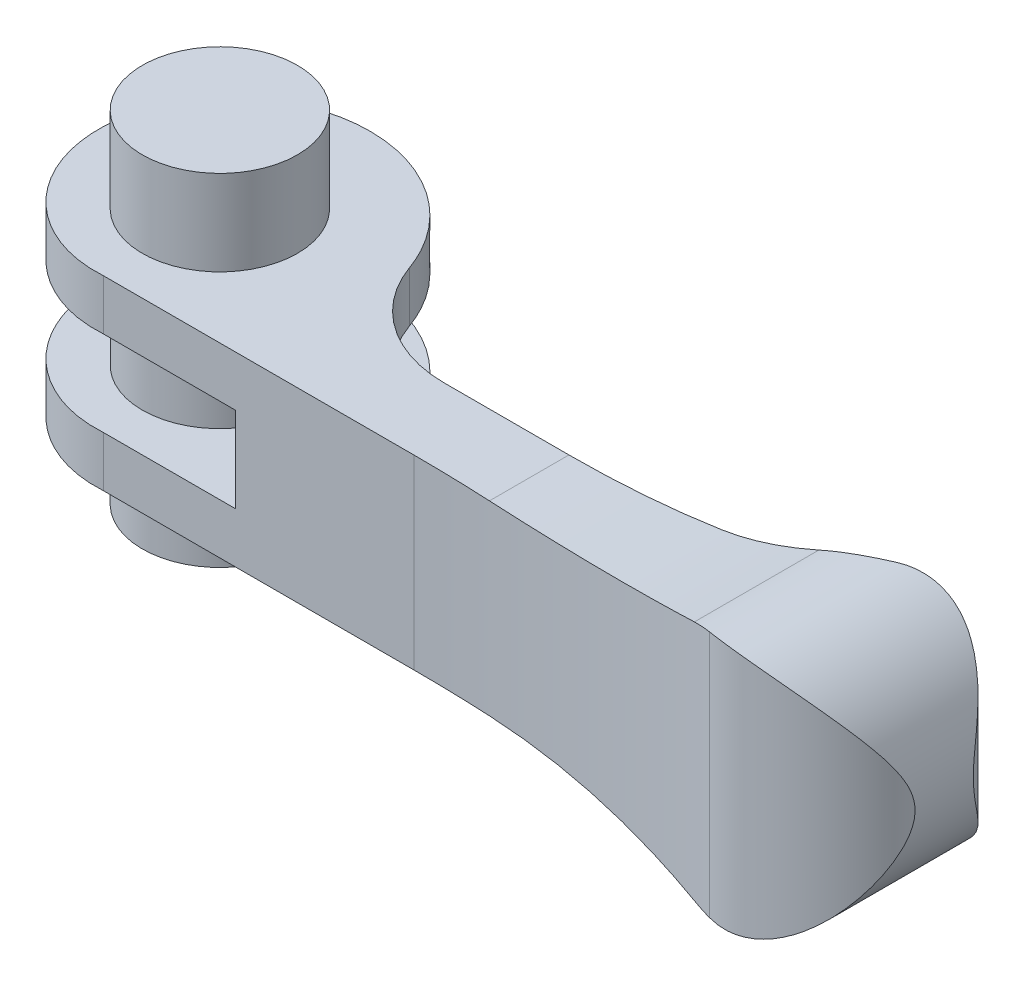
ISO-10303-21;
HEADER;
FILE_DESCRIPTION(('STEP AP214'),'2;1');
FILE_NAME('part.step','',(''),(''),'','','');
FILE_SCHEMA(('AUTOMOTIVE_DESIGN { 1 0 10303 214 1 1 1 1 }'));
ENDSEC;
DATA;
#1=APPLICATION_CONTEXT('core data for automotive mechanical design processes');
#2=APPLICATION_PROTOCOL_DEFINITION('international standard','automotive_design',2000,#1);
#3=PRODUCT_CONTEXT('',#1,'mechanical');
#4=PRODUCT('Part','Part','',(#3));
#5=PRODUCT_RELATED_PRODUCT_CATEGORY('part','',(#4));
#6=PRODUCT_DEFINITION_FORMATION('','',#4);
#7=PRODUCT_DEFINITION_CONTEXT('part definition',#1,'design');
#8=PRODUCT_DEFINITION('design','',#6,#7);
#9=PRODUCT_DEFINITION_SHAPE('','',#8);
#10=(LENGTH_UNIT() NAMED_UNIT(*) SI_UNIT(.MILLI.,.METRE.));
#11=(NAMED_UNIT(*) PLANE_ANGLE_UNIT() SI_UNIT($,.RADIAN.));
#12=(NAMED_UNIT(*) SI_UNIT($,.STERADIAN.) SOLID_ANGLE_UNIT());
#13=UNCERTAINTY_MEASURE_WITH_UNIT(LENGTH_MEASURE(1.E-05),#10,'distance_accuracy_value','');
#14=(GEOMETRIC_REPRESENTATION_CONTEXT(3) GLOBAL_UNCERTAINTY_ASSIGNED_CONTEXT((#13)) GLOBAL_UNIT_ASSIGNED_CONTEXT((#10,
#11,#12)) REPRESENTATION_CONTEXT('',''));
#15=CARTESIAN_POINT('',(0.,0.,0.));
#16=DIRECTION('',(0.,0.,1.));
#17=DIRECTION('',(1.,0.,0.));
#18=AXIS2_PLACEMENT_3D('',#15,#16,#17);
#19=CARTESIAN_POINT('',(20.0000000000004,-8.,107.050000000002));
#20=DIRECTION('',(0.,1.,0.));
#21=DIRECTION('',(1.00000000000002,0.,0.));
#22=AXIS2_PLACEMENT_3D('',#19,#20,#21);
#23=CYLINDRICAL_SURFACE('',#22,99.55);
#24=CARTESIAN_POINT('',(40.1433447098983,7.7815699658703,9.55924062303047));
#25=CARTESIAN_POINT('',(40.2458941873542,7.80603937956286,9.58042855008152));
#26=CARTESIAN_POINT('',(40.3488715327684,7.82846573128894,9.60187471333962));
#27=CARTESIAN_POINT('',(40.5553761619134,7.86918752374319,9.64522558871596));
#28=CARTESIAN_POINT('',(40.6589023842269,7.88748913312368,9.66712956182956));
#29=CARTESIAN_POINT('',(40.9704289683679,7.93625939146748,9.73356333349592));
#30=CARTESIAN_POINT('',(41.1792613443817,7.96056586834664,9.77879105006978));
#31=CARTESIAN_POINT('',(41.3886034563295,7.97660292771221,9.82484820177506));
#32=B_SPLINE_CURVE_WITH_KNOTS('',3,(#24,#25,#26,#27,#28,#29,#30,#31),.UNSPECIFIED.,.F.,.F.,(4,2,
2,4),(0.,0.322577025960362,0.644668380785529,1.28921460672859),.UNSPECIFIED.);
#33=CARTESIAN_POINT('',(40.1433447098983,7.7815699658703,9.55924062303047));
#34=VERTEX_POINT('',#33);
#35=CARTESIAN_POINT('',(41.3886034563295,7.97660292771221,9.82484820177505));
#36=VERTEX_POINT('',#35);
#37=EDGE_CURVE('E177',#34,#36,#32,.T.);
#38=ORIENTED_EDGE('',*,*,#37,.F.);
#39=CARTESIAN_POINT('',(25.0000000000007,6.,7.62564433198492));
#40=CARTESIAN_POINT('',(25.6432150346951,5.99999671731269,7.65798661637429));
#41=CARTESIAN_POINT('',(26.2860644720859,6.00951199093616,7.69657845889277));
#42=CARTESIAN_POINT('',(27.5703265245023,6.04748034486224,7.78617549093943));
#43=CARTESIAN_POINT('',(28.2117391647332,6.07593309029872,7.83718046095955));
#44=CARTESIAN_POINT('',(30.1265504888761,6.18917961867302,8.00813073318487));
#45=CARTESIAN_POINT('',(31.3968109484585,6.3018644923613,8.14632916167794));
#46=CARTESIAN_POINT('',(33.9225081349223,6.60041769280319,8.47014726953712));
#47=CARTESIAN_POINT('',(35.1779454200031,6.78628325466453,8.65576515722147));
#48=CARTESIAN_POINT('',(37.0486962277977,7.11891974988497,8.96867057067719));
#49=CARTESIAN_POINT('',(37.6717158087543,7.23913092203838,9.07903027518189));
#50=CARTESIAN_POINT('',(38.9119872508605,7.49719375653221,9.31087118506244));
#51=CARTESIAN_POINT('',(39.529239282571,7.63504489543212,9.4323520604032));
#52=CARTESIAN_POINT('',(40.1433447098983,7.7815699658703,9.55924062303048));
#53=B_SPLINE_CURVE_WITH_KNOTS('',3,(#39,#40,#41,#42,#43,#44,#45,#46,#47,#48,#49,#50,#51,#52),
.UNSPECIFIED.,.F.,.F.,(4,2,2,2,2,2,4),(0.,1.93188145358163,3.86372874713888,7.70857673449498,
11.5532794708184,13.4850725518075,15.4168083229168),.UNSPECIFIED.);
#54=CARTESIAN_POINT('',(25.0000000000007,6.,7.62564433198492));
#55=VERTEX_POINT('',#54);
#56=EDGE_CURVE('E145',#55,#34,#53,.T.);
#57=ORIENTED_EDGE('',*,*,#56,.F.);
#58=CARTESIAN_POINT('',(20.0000000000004,6.,107.050000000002));
#59=DIRECTION('',(0.,1.,0.));
#60=DIRECTION('',(1.00000000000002,0.,0.));
#61=AXIS2_PLACEMENT_3D('',#58,#59,#60);
#62=CIRCLE('',#61,99.55);
#63=CARTESIAN_POINT('',(20.0000000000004,6.,7.50000000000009));
#64=VERTEX_POINT('',#63);
#65=EDGE_CURVE('E154',#64,#55,#62,.F.);
#66=ORIENTED_EDGE('',*,*,#65,.F.);
#67=DIRECTION('',(0.,1.,0.));
#68=VECTOR('',#67,1.);
#69=CARTESIAN_POINT('',(20.0000000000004,-8.,7.50000000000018));
#70=LINE('',#69,#68);
#71=CARTESIAN_POINT('',(20.0000000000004,-6.,7.50000000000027));
#72=VERTEX_POINT('',#71);
#73=EDGE_CURVE('E303',#72,#64,#70,.T.);
#74=ORIENTED_EDGE('',*,*,#73,.F.);
#75=CARTESIAN_POINT('',(20.0000000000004,-6.,107.050000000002));
#76=DIRECTION('',(0.,1.,0.));
#77=DIRECTION('',(1.00000000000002,0.,0.));
#78=AXIS2_PLACEMENT_3D('',#75,#76,#77);
#79=CIRCLE('',#78,99.55);
#80=CARTESIAN_POINT('',(25.0000000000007,-6.,7.62564433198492));
#81=VERTEX_POINT('',#80);
#82=EDGE_CURVE('E558',#72,#81,#79,.F.);
#83=ORIENTED_EDGE('',*,*,#82,.T.);
#84=CARTESIAN_POINT('',(25.0000000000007,-6.,7.62564433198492));
#85=CARTESIAN_POINT('',(25.6432150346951,-5.99999671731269,7.65798661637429));
#86=CARTESIAN_POINT('',(26.2860644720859,-6.00951199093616,7.69657845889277));
#87=CARTESIAN_POINT('',(27.5703265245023,-6.04748034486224,7.78617549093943));
#88=CARTESIAN_POINT('',(28.2117391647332,-6.07593309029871,7.83718046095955));
#89=CARTESIAN_POINT('',(30.1265504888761,-6.189179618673,8.00813073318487));
#90=CARTESIAN_POINT('',(31.3968109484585,-6.3018644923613,8.14632916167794));
#91=CARTESIAN_POINT('',(33.9225081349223,-6.6004176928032,8.47014726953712));
#92=CARTESIAN_POINT('',(35.1779454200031,-6.78628325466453,8.65576515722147));
#93=CARTESIAN_POINT('',(37.0486962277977,-7.11891974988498,8.96867057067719));
#94=CARTESIAN_POINT('',(37.6717158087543,-7.2391309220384,9.0790302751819));
#95=CARTESIAN_POINT('',(38.9119872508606,-7.49719375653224,9.31087118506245));
#96=CARTESIAN_POINT('',(39.529239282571,-7.63504489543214,9.43235206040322));
#97=CARTESIAN_POINT('',(40.1433447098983,-7.78156996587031,9.55924062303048));
#98=B_SPLINE_CURVE_WITH_KNOTS('',3,(#84,#85,#86,#87,#88,#89,#90,#91,#92,#93,#94,#95,#96,#97),
.UNSPECIFIED.,.F.,.F.,(4,2,2,2,2,2,4),(0.,1.93188145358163,3.86372874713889,7.708576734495,
11.5532794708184,13.4850725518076,15.4168083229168),.UNSPECIFIED.);
#99=CARTESIAN_POINT('',(40.1433447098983,-7.7815699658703,9.55924062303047));
#100=VERTEX_POINT('',#99);
#101=EDGE_CURVE('E552',#81,#100,#98,.T.);
#102=ORIENTED_EDGE('',*,*,#101,.T.);
#103=CARTESIAN_POINT('',(40.1433447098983,-7.7815699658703,9.55924062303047));
#104=CARTESIAN_POINT('',(40.2458941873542,-7.80603937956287,9.58042855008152));
#105=CARTESIAN_POINT('',(40.3488715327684,-7.82846573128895,9.60187471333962));
#106=CARTESIAN_POINT('',(40.5553761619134,-7.86918752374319,9.64522558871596));
#107=CARTESIAN_POINT('',(40.6589023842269,-7.88748913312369,9.66712956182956));
#108=CARTESIAN_POINT('',(40.9704289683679,-7.93625939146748,9.73356333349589));
#109=CARTESIAN_POINT('',(41.1792613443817,-7.96056586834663,9.77879105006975));
#110=CARTESIAN_POINT('',(41.3886034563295,-7.9766029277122,9.82484820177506));
#111=B_SPLINE_CURVE_WITH_KNOTS('',3,(#103,#104,#105,#106,#107,#108,#109,#110),.UNSPECIFIED.,.F.,
.F.,(4,2,2,4),(0.,0.322577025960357,0.644668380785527,1.28921460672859),.UNSPECIFIED.);
#112=CARTESIAN_POINT('',(41.3886034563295,-7.9766029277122,9.82484820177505));
#113=VERTEX_POINT('',#112);
#114=EDGE_CURVE('E223',#100,#113,#111,.T.);
#115=ORIENTED_EDGE('',*,*,#114,.T.);
#116=DIRECTION('',(0.,1.,0.));
#117=VECTOR('',#116,1.);
#118=CARTESIAN_POINT('',(41.3886034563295,-8.,9.82484820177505));
#119=LINE('',#118,#117);
#120=EDGE_CURVE('E286',#113,#36,#119,.T.);
#121=ORIENTED_EDGE('',*,*,#120,.T.);
#122=EDGE_LOOP('',(#38,#57,#66,#74,#83,#102,#115,#121));
#123=FACE_BOUND('',#122,.T.);
#124=ADVANCED_FACE('F14',(#123),#23,.F.);
#125=CARTESIAN_POINT('',(0.,-8.,7.50000000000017));
#126=DIRECTION('',(0.,0.,-1.00000000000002));
#127=DIRECTION('',(1.00000000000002,0.,0.));
#128=AXIS2_PLACEMENT_3D('',#125,#126,#127);
#129=PLANE('',#128);
#130=DIRECTION('',(1.00000000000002,0.,0.));
#131=VECTOR('',#130,1.);
#132=CARTESIAN_POINT('',(0.,6.,7.50000000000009));
#133=LINE('',#132,#131);
#134=CARTESIAN_POINT('',(0.,6.,7.50000000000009));
#135=VERTEX_POINT('',#134);
#136=EDGE_CURVE('E165',#135,#64,#133,.T.);
#137=ORIENTED_EDGE('',*,*,#136,.F.);
#138=DIRECTION('',(0.,1.,0.));
#139=VECTOR('',#138,1.);
#140=CARTESIAN_POINT('',(0.,-8.,7.50000000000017));
#141=LINE('',#140,#139);
#142=CARTESIAN_POINT('',(0.,2.75,7.50000000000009));
#143=VERTEX_POINT('',#142);
#144=EDGE_CURVE('E294',#143,#135,#141,.T.);
#145=ORIENTED_EDGE('',*,*,#144,.F.);
#146=DIRECTION('',(1.00000000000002,0.,0.));
#147=VECTOR('',#146,1.);
#148=CARTESIAN_POINT('',(0.,2.75,7.50000000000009));
#149=LINE('',#148,#147);
#150=CARTESIAN_POINT('',(8.50000000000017,2.75,7.50000000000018));
#151=VERTEX_POINT('',#150);
#152=EDGE_CURVE('E42',#143,#151,#149,.T.);
#153=ORIENTED_EDGE('',*,*,#152,.T.);
#154=DIRECTION('',(0.,-1.,0.));
#155=VECTOR('',#154,1.);
#156=CARTESIAN_POINT('',(8.49999999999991,-8.,7.50000000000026));
#157=LINE('',#156,#155);
#158=CARTESIAN_POINT('',(8.50000000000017,-2.75,7.50000000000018));
#159=VERTEX_POINT('',#158);
#160=EDGE_CURVE('E367',#151,#159,#157,.T.);
#161=ORIENTED_EDGE('',*,*,#160,.T.);
#162=DIRECTION('',(-1.00000000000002,0.,0.));
#163=VECTOR('',#162,1.);
#164=CARTESIAN_POINT('',(0.,-2.75,7.50000000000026));
#165=LINE('',#164,#163);
#166=CARTESIAN_POINT('',(0.,-2.75,7.50000000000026));
#167=VERTEX_POINT('',#166);
#168=EDGE_CURVE('E361',#159,#167,#165,.T.);
#169=ORIENTED_EDGE('',*,*,#168,.T.);
#170=CARTESIAN_POINT('',(0.,-6.,7.50000000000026));
#171=VERTEX_POINT('',#170);
#172=EDGE_CURVE('E298',#171,#167,#141,.T.);
#173=ORIENTED_EDGE('',*,*,#172,.F.);
#174=DIRECTION('',(1.00000000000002,0.,0.));
#175=VECTOR('',#174,1.);
#176=CARTESIAN_POINT('',(0.,-6.,7.50000000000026));
#177=LINE('',#176,#175);
#178=EDGE_CURVE('E560',#171,#72,#177,.T.);
#179=ORIENTED_EDGE('',*,*,#178,.T.);
#180=ORIENTED_EDGE('',*,*,#73,.T.);
#181=EDGE_LOOP('',(#137,#145,#153,#161,#169,#173,#179,#180));
#182=FACE_BOUND('',#181,.T.);
#183=ADVANCED_FACE('F274',(#182),#129,.F.);
#184=CARTESIAN_POINT('',(0.,-8.,7.50000000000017));
#185=CARTESIAN_POINT('',(-0.981747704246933,-8.,7.56864583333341));
#186=CARTESIAN_POINT('',(-1.99074321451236,-8.,7.44195209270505));
#187=CARTESIAN_POINT('',(-3.90712600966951,-8.,6.79676377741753));
#188=CARTESIAN_POINT('',(-4.81367689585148,-8.,6.27832416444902));
#189=CARTESIAN_POINT('',(-6.37540403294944,-8.,4.91075676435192));
#190=CARTESIAN_POINT('',(-7.02981358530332,-8.,4.06201483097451));
#191=CARTESIAN_POINT('',(-7.96994804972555,-8.,2.15108987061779));
#192=CARTESIAN_POINT('',(-8.25510416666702,-8.,1.0895763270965));
#193=CARTESIAN_POINT('',(-8.39239583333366,-8.,-1.08957632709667));
#194=CARTESIAN_POINT('',(-8.24426208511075,-8.,-2.20635803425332));
#195=CARTESIAN_POINT('',(-7.51654531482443,-8.,-4.32198214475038));
#196=CARTESIAN_POINT('',(-6.93704972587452,-8.,-5.31990975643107));
#197=CARTESIAN_POINT('',(-5.41698962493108,-8.,-7.03412959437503));
#198=CARTESIAN_POINT('',(-4.47687096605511,-8.,-7.74959512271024));
#199=CARTESIAN_POINT('',(-2.36670469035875,-8.,-8.77225804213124));
#200=CARTESIAN_POINT('',(-1.19740494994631,-8.,-9.07885416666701));
#201=CARTESIAN_POINT('',(1.19740494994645,-8.,-9.21614583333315));
#202=CARTESIAN_POINT('',(2.42197285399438,-8.,-9.04657207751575));
#203=CARTESIAN_POINT('',(4.73683827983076,-8.,-8.23632685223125));
#204=CARTESIAN_POINT('',(5.82614261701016,-8.,-7.59577528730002));
#205=CARTESIAN_POINT('',(7.69285515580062,-8.,-5.9232224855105));
#206=CARTESIAN_POINT('',(8.46937666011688,-8.,-4.89172710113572));
#207=CARTESIAN_POINT('',(9.57456803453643,-8.,-2.5823195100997));
#208=CARTESIAN_POINT('',(9.90260416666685,-8.,-1.30523357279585));
#209=CARTESIAN_POINT('',(10.0398958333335,-8.,1.30523357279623));
#210=CARTESIAN_POINT('',(9.84888206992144,-8.,2.63758767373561));
#211=CARTESIAN_POINT('',(8.95610838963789,-8.,5.15169441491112));
#212=CARTESIAN_POINT('',(8.25450084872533,-8.,6.33237547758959));
#213=CARTESIAN_POINT('',(6.42945534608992,-8.,8.35158071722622));
#214=CARTESIAN_POINT('',(5.30658323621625,-8.,9.18915819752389));
#215=CARTESIAN_POINT('',(2.79793432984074,-8.,10.3768780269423));
#216=CARTESIAN_POINT('',(1.41306219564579,-8.,10.726354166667));
#217=CARTESIAN_POINT('',(-1.10114765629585E-13,-8.,10.7950000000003));
#218=B_SPLINE_CURVE_WITH_KNOTS('',3,(#184,#185,#186,#187,#188,#189,#190,#191,#192,#193,#194,
#195,#196,#197,#198,#199,#200,#201,#202,#203,#204,#205,#206,#207,#208,#209,#210,#211,#212,#213,
#214,#215,#216,#217),.UNSPECIFIED.,.F.,.F.,(4,2,2,2,2,2,2,2,2,2,2,2,2,2,2,2,4),(0.,0.0625,0.125,
0.1875,0.25,0.3125,0.375,0.4375,0.5,0.5625,0.625,0.6875,0.75,0.8125,0.875,0.9375,1.),.UNSPECIFIED.);
#219=DIRECTION('',(0.,1.,0.));
#220=VECTOR('',#219,1.);
#221=SURFACE_OF_LINEAR_EXTRUSION('',#218,#220);
#222=CARTESIAN_POINT('',(0.,6.,7.50000000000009));
#223=CARTESIAN_POINT('',(-0.981747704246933,6.,7.56864583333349));
#224=CARTESIAN_POINT('',(-1.9907432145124,6.,7.44195209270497));
#225=CARTESIAN_POINT('',(-3.9071260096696,6.,6.79676377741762));
#226=CARTESIAN_POINT('',(-4.81367689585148,6.,6.27832416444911));
#227=CARTESIAN_POINT('',(-6.37540403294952,6.,4.91075676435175));
#228=CARTESIAN_POINT('',(-7.02981358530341,6.,4.06201483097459));
#229=CARTESIAN_POINT('',(-7.96994804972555,5.99999999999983,2.15108987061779));
#230=CARTESIAN_POINT('',(-8.25510416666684,5.99999999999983,1.08957632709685));
#231=CARTESIAN_POINT('',(-8.39239583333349,5.99999999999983,-1.08957632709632));
#232=CARTESIAN_POINT('',(-8.24426208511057,5.99999999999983,-2.20635803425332));
#233=CARTESIAN_POINT('',(-7.51654531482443,5.99999999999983,-4.32198214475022));
#234=CARTESIAN_POINT('',(-6.93704972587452,5.99999999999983,-5.31990975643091));
#235=CARTESIAN_POINT('',(-5.41698962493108,5.99999999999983,-7.03412959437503));
#236=CARTESIAN_POINT('',(-4.47687096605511,5.99999999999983,-7.74959512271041));
#237=CARTESIAN_POINT('',(-2.36670469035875,6.,-8.77225804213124));
#238=CARTESIAN_POINT('',(-1.19740494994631,6.,-9.07885416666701));
#239=CARTESIAN_POINT('',(1.19740494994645,6.,-9.21614583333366));
#240=CARTESIAN_POINT('',(2.42197285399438,6.,-9.04657207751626));
#241=CARTESIAN_POINT('',(4.73683827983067,6.,-8.23632685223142));
#242=CARTESIAN_POINT('',(5.82614261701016,5.99999999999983,-7.59577528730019));
#243=CARTESIAN_POINT('',(7.69285515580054,5.99999999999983,-5.9232224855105));
#244=CARTESIAN_POINT('',(8.46937666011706,5.99999999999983,-4.89172710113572));
#245=CARTESIAN_POINT('',(9.5745680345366,5.99999999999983,-2.5823195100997));
#246=CARTESIAN_POINT('',(9.90260416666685,5.99999999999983,-1.30523357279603));
#247=CARTESIAN_POINT('',(10.0398958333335,5.99999999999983,1.30523357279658));
#248=CARTESIAN_POINT('',(9.84888206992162,5.99999999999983,2.63758767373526));
#249=CARTESIAN_POINT('',(8.95610838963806,6.,5.1516944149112));
#250=CARTESIAN_POINT('',(8.25450084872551,6.,6.33237547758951));
#251=CARTESIAN_POINT('',(6.42945534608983,6.,8.35158071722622));
#252=CARTESIAN_POINT('',(5.30658323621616,6.,9.18915819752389));
#253=CARTESIAN_POINT('',(2.7979343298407,6.,10.3768780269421));
#254=CARTESIAN_POINT('',(1.41306219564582,6.,10.7263541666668));
#255=CARTESIAN_POINT('',(-1.10662244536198E-13,6.,10.7950000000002));
#256=B_SPLINE_CURVE_WITH_KNOTS('',3,(#222,#223,#224,#225,#226,#227,#228,#229,#230,#231,#232,
#233,#234,#235,#236,#237,#238,#239,#240,#241,#242,#243,#244,#245,#246,#247,#248,#249,#250,#251,
#252,#253,#254,#255),.UNSPECIFIED.,.F.,.F.,(4,2,2,2,2,2,2,2,2,2,2,2,2,2,2,2,4),(0.,0.0625,0.125,
0.1875,0.25,0.3125,0.375,0.4375,0.5,0.5625,0.625,0.6875,0.75,0.8125,0.875,0.9375,1.),.UNSPECIFIED.);
#257=CARTESIAN_POINT('',(9.40828544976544,5.99999999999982,-2.8091588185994));
#258=VERTEX_POINT('',#257);
#259=EDGE_CURVE('E163',#258,#135,#256,.F.);
#260=ORIENTED_EDGE('',*,*,#259,.F.);
#261=DIRECTION('',(0.,1.,0.));
#262=VECTOR('',#261,1.);
#263=CARTESIAN_POINT('',(9.40828544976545,7.99999999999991,-2.80915881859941));
#264=LINE('',#263,#262);
#265=CARTESIAN_POINT('',(9.40828544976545,2.74999999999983,-2.80915881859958));
#266=VERTEX_POINT('',#265);
#267=EDGE_CURVE('E35',#258,#266,#264,.F.);
#268=ORIENTED_EDGE('',*,*,#267,.T.);
#269=CARTESIAN_POINT('',(0.,2.75,7.50000000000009));
#270=CARTESIAN_POINT('',(-0.981747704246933,2.75,7.56864583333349));
#271=CARTESIAN_POINT('',(-1.99074321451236,2.75,7.44195209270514));
#272=CARTESIAN_POINT('',(-3.9071260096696,2.75,6.79676377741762));
#273=CARTESIAN_POINT('',(-4.81367689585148,2.75,6.27832416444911));
#274=CARTESIAN_POINT('',(-6.37540403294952,2.75,4.91075676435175));
#275=CARTESIAN_POINT('',(-7.02981358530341,2.75,4.06201483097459));
#276=CARTESIAN_POINT('',(-7.96994804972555,2.74999999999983,2.15108987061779));
#277=CARTESIAN_POINT('',(-8.25510416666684,2.74999999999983,1.08957632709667));
#278=CARTESIAN_POINT('',(-8.39239583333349,2.74999999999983,-1.08957632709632));
#279=CARTESIAN_POINT('',(-8.24426208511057,2.74999999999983,-2.20635803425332));
#280=CARTESIAN_POINT('',(-7.51654531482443,2.74999999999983,-4.32198214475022));
#281=CARTESIAN_POINT('',(-6.93704972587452,2.74999999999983,-5.31990975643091));
#282=CARTESIAN_POINT('',(-5.41698962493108,2.74999999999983,-7.03412959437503));
#283=CARTESIAN_POINT('',(-4.47687096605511,2.74999999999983,-7.74959512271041));
#284=CARTESIAN_POINT('',(-2.36670469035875,2.74999999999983,-8.77225804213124));
#285=CARTESIAN_POINT('',(-1.19740494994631,2.74999999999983,-9.07885416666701));
#286=CARTESIAN_POINT('',(1.19740494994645,2.74999999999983,-9.21614583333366));
#287=CARTESIAN_POINT('',(2.42197285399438,2.74999999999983,-9.04657207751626));
#288=CARTESIAN_POINT('',(4.73683827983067,2.74999999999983,-8.23632685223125));
#289=CARTESIAN_POINT('',(5.82614261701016,2.75,-7.59577528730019));
#290=CARTESIAN_POINT('',(7.69285515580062,2.75,-5.9232224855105));
#291=CARTESIAN_POINT('',(8.46937666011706,2.75,-4.89172710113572));
#292=CARTESIAN_POINT('',(9.5745680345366,2.74999999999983,-2.5823195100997));
#293=CARTESIAN_POINT('',(9.90260416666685,2.74999999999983,-1.30523357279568));
#294=CARTESIAN_POINT('',(10.0398958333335,2.74999999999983,1.30523357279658));
#295=CARTESIAN_POINT('',(9.84888206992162,2.74999999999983,2.63758767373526));
#296=CARTESIAN_POINT('',(8.95610838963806,2.75,5.1516944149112));
#297=CARTESIAN_POINT('',(8.25450084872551,2.75,6.33237547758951));
#298=CARTESIAN_POINT('',(6.42945534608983,2.75,8.35158071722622));
#299=CARTESIAN_POINT('',(5.30658323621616,2.75,9.18915819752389));
#300=CARTESIAN_POINT('',(2.79793432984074,2.75,10.3768780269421));
#301=CARTESIAN_POINT('',(1.41306219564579,2.75,10.7263541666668));
#302=CARTESIAN_POINT('',(-1.10535151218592E-13,2.75,10.7950000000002));
#303=B_SPLINE_CURVE_WITH_KNOTS('',3,(#269,#270,#271,#272,#273,#274,#275,#276,#277,#278,#279,
#280,#281,#282,#283,#284,#285,#286,#287,#288,#289,#290,#291,#292,#293,#294,#295,#296,#297,#298,
#299,#300,#301,#302),.UNSPECIFIED.,.F.,.F.,(4,2,2,2,2,2,2,2,2,2,2,2,2,2,2,2,4),(0.,0.0625,0.125,
0.1875,0.25,0.3125,0.375,0.4375,0.5,0.5625,0.625,0.6875,0.75,0.8125,0.875,0.9375,1.),.UNSPECIFIED.);
#304=EDGE_CURVE('E309',#266,#143,#303,.F.);
#305=ORIENTED_EDGE('',*,*,#304,.T.);
#306=ORIENTED_EDGE('',*,*,#144,.T.);
#307=EDGE_LOOP('',(#260,#268,#305,#306));
#308=FACE_BOUND('',#307,.T.);
#309=ADVANCED_FACE('F280',(#308),#221,.F.);
#310=CARTESIAN_POINT('',(9.7876235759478,-8.,2.50000000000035));
#311=DIRECTION('',(0.,0.,1.00000000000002));
#312=DIRECTION('',(-1.00000000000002,0.,0.));
#313=AXIS2_PLACEMENT_3D('',#310,#311,#312);
#314=PLANE('',#313);
#315=CARTESIAN_POINT('',(25.0000000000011,71.25,2.50000000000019));
#316=DIRECTION('',(0.,0.,1.00000000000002));
#317=DIRECTION('',(-1.00000000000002,0.,0.));
#318=AXIS2_PLACEMENT_3D('',#315,#316,#317);
#319=CIRCLE('',#318,65.25);
#320=CARTESIAN_POINT('',(34.8532515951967,6.74824860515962,2.5));
#321=VERTEX_POINT('',#320);
#322=CARTESIAN_POINT('',(25.0000000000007,5.99999999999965,2.50000000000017));
#323=VERTEX_POINT('',#322);
#324=EDGE_CURVE('E134',#321,#323,#319,.F.);
#325=ORIENTED_EDGE('',*,*,#324,.F.);
#326=DIRECTION('',(0.,1.,0.));
#327=VECTOR('',#326,1.);
#328=CARTESIAN_POINT('',(34.8532515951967,-8.,2.5));
#329=LINE('',#328,#327);
#330=CARTESIAN_POINT('',(34.8532515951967,-6.74824860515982,2.5));
#331=VERTEX_POINT('',#330);
#332=EDGE_CURVE('E290',#331,#321,#329,.T.);
#333=ORIENTED_EDGE('',*,*,#332,.F.);
#334=CARTESIAN_POINT('',(25.0000000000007,-71.25,2.5));
#335=DIRECTION('',(0.,0.,1.00000000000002));
#336=DIRECTION('',(-1.00000000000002,0.,0.));
#337=AXIS2_PLACEMENT_3D('',#334,#335,#336);
#338=CIRCLE('',#337,65.25);
#339=CARTESIAN_POINT('',(25.0000000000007,-6.,2.5));
#340=VERTEX_POINT('',#339);
#341=EDGE_CURVE('E258',#331,#340,#338,.T.);
#342=ORIENTED_EDGE('',*,*,#341,.T.);
#343=DIRECTION('',(-1.00000000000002,0.,0.));
#344=VECTOR('',#343,1.);
#345=CARTESIAN_POINT('',(9.7876235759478,-6.,2.5));
#346=LINE('',#345,#344);
#347=CARTESIAN_POINT('',(16.942167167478,-6.,2.5));
#348=VERTEX_POINT('',#347);
#349=EDGE_CURVE('E330',#340,#348,#346,.T.);
#350=ORIENTED_EDGE('',*,*,#349,.T.);
#351=DIRECTION('',(0.,-1.,0.));
#352=VECTOR('',#351,1.);
#353=CARTESIAN_POINT('',(16.942167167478,7.99999999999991,2.50000000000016));
#354=LINE('',#353,#352);
#355=CARTESIAN_POINT('',(16.942167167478,-2.75,2.5));
#356=VERTEX_POINT('',#355);
#357=EDGE_CURVE('E315',#348,#356,#354,.F.);
#358=ORIENTED_EDGE('',*,*,#357,.T.);
#359=DIRECTION('',(-1.00000000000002,0.,0.));
#360=VECTOR('',#359,1.);
#361=CARTESIAN_POINT('',(18.5000000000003,-2.75,2.50000000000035));
#362=LINE('',#361,#360);
#363=CARTESIAN_POINT('',(8.50000000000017,-2.75,2.5));
#364=VERTEX_POINT('',#363);
#365=EDGE_CURVE('E341',#356,#364,#362,.T.);
#366=ORIENTED_EDGE('',*,*,#365,.T.);
#367=DIRECTION('',(0.,1.,0.));
#368=VECTOR('',#367,1.);
#369=CARTESIAN_POINT('',(8.50000000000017,-2.75,2.5));
#370=LINE('',#369,#368);
#371=CARTESIAN_POINT('',(8.50000000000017,2.74999999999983,2.5));
#372=VERTEX_POINT('',#371);
#373=EDGE_CURVE('E339',#364,#372,#370,.T.);
#374=ORIENTED_EDGE('',*,*,#373,.T.);
#375=DIRECTION('',(-1.00000000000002,0.,0.));
#376=VECTOR('',#375,1.);
#377=CARTESIAN_POINT('',(18.5000000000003,2.75,2.50000000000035));
#378=LINE('',#377,#376);
#379=CARTESIAN_POINT('',(16.942167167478,2.75,2.5));
#380=VERTEX_POINT('',#379);
#381=EDGE_CURVE('E336',#380,#372,#378,.T.);
#382=ORIENTED_EDGE('',*,*,#381,.F.);
#383=CARTESIAN_POINT('',(16.942167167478,6.,2.50000000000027));
#384=VERTEX_POINT('',#383);
#385=EDGE_CURVE('E162',#380,#384,#354,.F.);
#386=ORIENTED_EDGE('',*,*,#385,.T.);
#387=DIRECTION('',(-1.00000000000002,0.,0.));
#388=VECTOR('',#387,1.);
#389=CARTESIAN_POINT('',(9.78762357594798,5.99999999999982,2.5));
#390=LINE('',#389,#388);
#391=EDGE_CURVE('E151',#323,#384,#390,.T.);
#392=ORIENTED_EDGE('',*,*,#391,.F.);
#393=EDGE_LOOP('',(#325,#333,#342,#350,#358,#366,#374,#382,#386,#392));
#394=FACE_BOUND('',#393,.T.);
#395=ADVANCED_FACE('F159',(#394),#314,.F.);
#396=CARTESIAN_POINT('',(34.8532515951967,-8.,-12.5));
#397=DIRECTION('',(0.,1.,0.));
#398=DIRECTION('',(1.00000000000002,0.,0.));
#399=AXIS2_PLACEMENT_3D('',#396,#397,#398);
#400=CYLINDRICAL_SURFACE('',#399,15.);
#401=CARTESIAN_POINT('',(43.4276734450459,7.87157852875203,-0.192307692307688));
#402=CARTESIAN_POINT('',(43.2330964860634,7.90688424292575,-0.0567088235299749));
#403=CARTESIAN_POINT('',(43.0343618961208,7.93546031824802,0.0748476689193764));
#404=CARTESIAN_POINT('',(42.6294150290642,7.97779975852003,0.329195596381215));
#405=CARTESIAN_POINT('',(42.423191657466,7.99154013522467,0.451973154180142));
#406=CARTESIAN_POINT('',(42.0087624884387,8.00262854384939,0.685377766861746));
#407=CARTESIAN_POINT('',(41.8006722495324,8.00028859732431,0.796193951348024));
#408=CARTESIAN_POINT('',(41.3803562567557,7.97873783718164,1.00748429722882));
#409=CARTESIAN_POINT('',(41.1681347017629,7.95954335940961,1.1079683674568));
#410=CARTESIAN_POINT('',(40.8205226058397,7.9137322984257,1.26274941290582));
#411=CARTESIAN_POINT('',(40.6858632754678,7.89251801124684,1.32034222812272));
#412=CARTESIAN_POINT('',(40.4152492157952,7.84267986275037,1.43146636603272));
#413=CARTESIAN_POINT('',(40.2792916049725,7.81401139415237,1.48497063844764));
#414=CARTESIAN_POINT('',(40.1433447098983,7.78156996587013,1.53620015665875));
#415=B_SPLINE_CURVE_WITH_KNOTS('',3,(#401,#402,#403,#404,#405,#406,#407,#408,#409,#410,#411,
#412,#413,#414),.UNSPECIFIED.,.F.,.F.,(4,2,2,2,2,2,4),(0.,0.719320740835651,1.43975449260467,
2.14624901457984,2.85205953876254,3.29579458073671,3.74224871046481),.UNSPECIFIED.);
#416=CARTESIAN_POINT('',(43.4276734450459,7.87157852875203,-0.192307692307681));
#417=VERTEX_POINT('',#416);
#418=CARTESIAN_POINT('',(40.1433447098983,7.78156996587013,1.53620015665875));
#419=VERTEX_POINT('',#418);
#420=EDGE_CURVE('E146',#417,#419,#415,.T.);
#421=ORIENTED_EDGE('',*,*,#420,.F.);
#422=DIRECTION('',(0.,1.,0.));
#423=VECTOR('',#422,1.);
#424=CARTESIAN_POINT('',(43.4276734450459,-8.,-0.192307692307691));
#425=LINE('',#424,#423);
#426=CARTESIAN_POINT('',(43.4276734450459,-7.8715785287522,-0.192307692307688));
#427=VERTEX_POINT('',#426);
#428=EDGE_CURVE('E295',#427,#417,#425,.T.);
#429=ORIENTED_EDGE('',*,*,#428,.F.);
#430=CARTESIAN_POINT('',(43.4276734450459,-7.8715785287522,-0.192307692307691));
#431=CARTESIAN_POINT('',(43.2330964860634,-7.90688424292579,-0.056708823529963));
#432=CARTESIAN_POINT('',(43.0343618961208,-7.93546031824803,0.0748476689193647));
#433=CARTESIAN_POINT('',(42.6294150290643,-7.97779975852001,0.329195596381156));
#434=CARTESIAN_POINT('',(42.4231916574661,-7.99154013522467,0.451973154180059));
#435=CARTESIAN_POINT('',(42.0087624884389,-8.00262854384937,0.685377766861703));
#436=CARTESIAN_POINT('',(41.8006722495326,-8.00028859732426,0.79619395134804));
#437=CARTESIAN_POINT('',(41.3803562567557,-7.9787378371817,1.00748429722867));
#438=CARTESIAN_POINT('',(41.1681347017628,-7.95954335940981,1.10796836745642));
#439=CARTESIAN_POINT('',(40.8205226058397,-7.91373229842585,1.26274941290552));
#440=CARTESIAN_POINT('',(40.6858632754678,-7.89251801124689,1.32034222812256));
#441=CARTESIAN_POINT('',(40.4152492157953,-7.84267986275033,1.43146636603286));
#442=CARTESIAN_POINT('',(40.2792916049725,-7.81401139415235,1.48497063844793));
#443=CARTESIAN_POINT('',(40.1433447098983,-7.7815699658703,1.5362001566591));
#444=B_SPLINE_CURVE_WITH_KNOTS('',3,(#430,#431,#432,#433,#434,#435,#436,#437,#438,#439,#440,
#441,#442,#443),.UNSPECIFIED.,.F.,.F.,(4,2,2,2,2,2,4),(0.,0.719320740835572,1.43975449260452,
2.14624901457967,2.85205953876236,3.29579458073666,3.74224871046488),.UNSPECIFIED.);
#445=CARTESIAN_POINT('',(40.1433447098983,-7.7815699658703,1.5362001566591));
#446=VERTEX_POINT('',#445);
#447=EDGE_CURVE('E224',#427,#446,#444,.T.);
#448=ORIENTED_EDGE('',*,*,#447,.T.);
#449=CARTESIAN_POINT('',(40.1433447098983,-7.7815699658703,1.53620015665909));
#450=CARTESIAN_POINT('',(39.7226989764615,-7.68115987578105,1.69478191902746));
#451=CARTESIAN_POINT('',(39.2943354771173,-7.58341808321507,1.83458508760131));
#452=CARTESIAN_POINT('',(38.4289272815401,-7.39532588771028,2.07443745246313));
#453=CARTESIAN_POINT('',(37.9919803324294,-7.30492227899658,2.1747978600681));
#454=CARTESIAN_POINT('',(37.1092559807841,-7.13189825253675,2.33616373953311));
#455=CARTESIAN_POINT('',(36.6634781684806,-7.04927819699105,2.39716738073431));
#456=CARTESIAN_POINT('',(35.9892167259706,-6.93163307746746,2.45864735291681));
#457=CARTESIAN_POINT('',(35.7625819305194,-6.89332037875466,2.47413735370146));
#458=CARTESIAN_POINT('',(35.3084550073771,-6.81901948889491,2.4948140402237));
#459=CARTESIAN_POINT('',(35.0809628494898,-6.78303138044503,2.50000035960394));
#460=CARTESIAN_POINT('',(34.8532515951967,-6.74824860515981,2.5));
#461=B_SPLINE_CURVE_WITH_KNOTS('',3,(#449,#450,#451,#452,#453,#454,#455,#456,#457,#458,#459,
#460),.UNSPECIFIED.,.F.,.F.,(4,2,2,2,2,4),(0.,1.38140175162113,2.75167395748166,
4.12200989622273,4.81291351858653,5.50384170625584),.UNSPECIFIED.);
#462=EDGE_CURVE('E292',#446,#331,#461,.T.);
#463=ORIENTED_EDGE('',*,*,#462,.T.);
#464=ORIENTED_EDGE('',*,*,#332,.T.);
#465=CARTESIAN_POINT('',(40.1433447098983,7.78156996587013,1.53620015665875));
#466=CARTESIAN_POINT('',(39.7226989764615,7.68115987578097,1.69478191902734));
#467=CARTESIAN_POINT('',(39.2943354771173,7.58341808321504,1.83458508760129));
#468=CARTESIAN_POINT('',(38.4289272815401,7.3953258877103,2.07443745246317));
#469=CARTESIAN_POINT('',(37.9919803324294,7.3049222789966,2.17479786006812));
#470=CARTESIAN_POINT('',(37.1092559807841,7.13189825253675,2.33616373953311));
#471=CARTESIAN_POINT('',(36.6634781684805,7.04927819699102,2.39716738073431));
#472=CARTESIAN_POINT('',(35.9892167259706,6.93163307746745,2.45864735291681));
#473=CARTESIAN_POINT('',(35.7625819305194,6.89332037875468,2.47413735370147));
#474=CARTESIAN_POINT('',(35.3084550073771,6.8190194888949,2.4948140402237));
#475=CARTESIAN_POINT('',(35.0809628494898,6.78303138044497,2.50000035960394));
#476=CARTESIAN_POINT('',(34.8532515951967,6.74824860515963,2.5));
#477=B_SPLINE_CURVE_WITH_KNOTS('',3,(#465,#466,#467,#468,#469,#470,#471,#472,#473,#474,#475,
#476),.UNSPECIFIED.,.F.,.F.,(4,2,2,2,2,4),(0.,1.38140175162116,2.75167395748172,
4.12200989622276,4.81291351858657,5.50384170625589),.UNSPECIFIED.);
#478=EDGE_CURVE('E9',#419,#321,#477,.T.);
#479=ORIENTED_EDGE('',*,*,#478,.F.);
#480=EDGE_LOOP('',(#421,#429,#448,#463,#464,#479));
#481=FACE_BOUND('',#480,.T.);
#482=ADVANCED_FACE('F188',(#481),#400,.F.);
#483=CARTESIAN_POINT('',(46.0000000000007,-8.,3.50000000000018));
#484=DIRECTION('',(0.,1.,0.));
#485=DIRECTION('',(1.00000000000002,0.,0.));
#486=AXIS2_PLACEMENT_3D('',#483,#484,#485);
#487=CYLINDRICAL_SURFACE('',#486,4.5);
#488=ORIENTED_EDGE('',*,*,#428,.T.);
#489=CARTESIAN_POINT('',(43.4276734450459,7.87157852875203,-0.192307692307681));
#490=CARTESIAN_POINT('',(43.5232585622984,7.85425856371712,-0.258928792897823));
#491=CARTESIAN_POINT('',(43.621184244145,7.83468392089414,-0.321607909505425));
#492=CARTESIAN_POINT('',(43.820746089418,7.79071577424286,-0.438804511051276));
#493=CARTESIAN_POINT('',(43.9223816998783,7.76632298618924,-0.493323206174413));
#494=CARTESIAN_POINT('',(44.1279526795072,7.71252682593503,-0.593712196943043));
#495=CARTESIAN_POINT('',(44.2318754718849,7.68314677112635,-0.639620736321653));
#496=CARTESIAN_POINT('',(44.4414685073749,7.61913593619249,-0.722996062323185));
#497=CARTESIAN_POINT('',(44.5471386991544,7.58450531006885,-0.76046309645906));
#498=CARTESIAN_POINT('',(44.7592373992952,7.50994309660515,-0.826992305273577));
#499=CARTESIAN_POINT('',(44.8656658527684,7.47001188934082,-0.85605508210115));
#500=CARTESIAN_POINT('',(45.0783878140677,7.38489389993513,-0.905970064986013));
#501=CARTESIAN_POINT('',(45.1846812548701,7.33970511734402,-0.926819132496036));
#502=CARTESIAN_POINT('',(45.3962371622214,7.24424197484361,-0.960599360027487));
#503=CARTESIAN_POINT('',(45.5014995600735,7.1939672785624,-0.973529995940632));
#504=CARTESIAN_POINT('',(45.7102658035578,7.08855491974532,-0.991886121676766));
#505=CARTESIAN_POINT('',(45.813768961,7.03341540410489,-0.997308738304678));
#506=CARTESIAN_POINT('',(46.0228790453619,6.91602811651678,-1.0012098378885));
#507=CARTESIAN_POINT('',(46.1283757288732,6.85357356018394,-0.99936972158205));
#508=CARTESIAN_POINT('',(46.3361454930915,6.7240506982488,-0.988634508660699));
#509=CARTESIAN_POINT('',(46.4384173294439,6.65698064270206,-0.979736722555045));
#510=CARTESIAN_POINT('',(46.7397120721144,6.44937990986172,-0.943391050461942));
#511=CARTESIAN_POINT('',(46.9332590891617,6.30243340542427,-0.906291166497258));
#512=CARTESIAN_POINT('',(47.2636061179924,6.0274695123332,-0.821561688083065));
#513=CARTESIAN_POINT('',(47.4037056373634,5.90209818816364,-0.777864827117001));
#514=CARTESIAN_POINT('',(47.6729193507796,5.64382658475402,-0.679935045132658));
#515=CARTESIAN_POINT('',(47.8020283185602,5.51092277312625,-0.625697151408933));
#516=CARTESIAN_POINT('',(48.173097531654,5.10182618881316,-0.450019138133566));
#517=CARTESIAN_POINT('',(48.3982631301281,4.81570115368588,-0.315767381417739));
#518=CARTESIAN_POINT('',(48.7387591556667,4.31840281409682,-0.0745883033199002));
#519=CARTESIAN_POINT('',(48.8661331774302,4.11269079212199,0.0272560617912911));
#520=CARTESIAN_POINT('',(49.1011367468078,3.69213917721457,0.23540844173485));
#521=CARTESIAN_POINT('',(49.2087515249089,3.47729290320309,0.341719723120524));
#522=CARTESIAN_POINT('',(49.404374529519,3.03857594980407,0.553645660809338));
#523=CARTESIAN_POINT('',(49.492385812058,2.81470668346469,0.659260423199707));
#524=CARTESIAN_POINT('',(49.6486711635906,2.35717822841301,0.863029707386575));
#525=CARTESIAN_POINT('',(49.7169671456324,2.12353024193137,0.961192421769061));
#526=CARTESIAN_POINT('',(49.8330737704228,1.64425791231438,1.14014631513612));
#527=CARTESIAN_POINT('',(49.8808886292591,1.398636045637,1.22094106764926));
#528=CARTESIAN_POINT('',(49.9354550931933,1.02202264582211,1.31743586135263));
#529=CARTESIAN_POINT('',(49.9507682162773,0.895435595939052,1.34544662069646));
#530=CARTESIAN_POINT('',(49.9753986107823,0.639885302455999,1.3912354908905));
#531=CARTESIAN_POINT('',(49.9847215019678,0.510924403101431,1.40902319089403));
#532=CARTESIAN_POINT('',(49.9939303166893,0.317973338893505,1.42670347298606));
#533=CARTESIAN_POINT('',(49.9962040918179,0.254483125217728,1.43109560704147));
#534=CARTESIAN_POINT('',(49.9992395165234,0.127333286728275,1.43697003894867));
#535=CARTESIAN_POINT('',(50.0000011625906,0.0636736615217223,1.43845233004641));
#536=CARTESIAN_POINT('',(49.9999974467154,-0.139840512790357,1.43843589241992));
#537=CARTESIAN_POINT('',(49.9963156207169,-0.27974872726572,1.43125022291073));
#538=CARTESIAN_POINT('',(49.9817438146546,-0.55787696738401,1.40334852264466));
#539=CARTESIAN_POINT('',(49.9708462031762,-0.696095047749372,1.38261816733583));
#540=CARTESIAN_POINT('',(49.9277401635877,-1.10784791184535,1.3030788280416));
#541=CARTESIAN_POINT('',(49.8851250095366,-1.37694580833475,1.22696039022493));
#542=CARTESIAN_POINT('',(49.78597359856,-1.85091760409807,1.06616759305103));
#543=CARTESIAN_POINT('',(49.7335866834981,-2.05832238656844,0.985824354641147));
#544=CARTESIAN_POINT('',(49.6136585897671,-2.46517873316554,0.816292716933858));
#545=CARTESIAN_POINT('',(49.54610581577,-2.66462407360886,0.727097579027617));
#546=CARTESIAN_POINT('',(49.3960507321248,-3.05656093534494,0.545209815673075));
#547=CARTESIAN_POINT('',(49.3135228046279,-3.24903985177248,0.452511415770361));
#548=CARTESIAN_POINT('',(49.1335608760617,-3.62713445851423,0.267750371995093));
#549=CARTESIAN_POINT('',(49.0361316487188,-3.8127523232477,0.175687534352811));
#550=CARTESIAN_POINT('',(48.8171048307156,-4.19275595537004,-0.0123361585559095));
#551=CARTESIAN_POINT('',(48.6941529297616,-4.38653401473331,-0.107957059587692));
#552=CARTESIAN_POINT('',(48.4298991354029,-4.765474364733,-0.290967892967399));
#553=CARTESIAN_POINT('',(48.2885904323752,-4.95063342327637,-0.378354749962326));
#554=CARTESIAN_POINT('',(47.9879892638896,-5.31024333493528,-0.540664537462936));
#555=CARTESIAN_POINT('',(47.8287724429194,-5.48473475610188,-0.615636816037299));
#556=CARTESIAN_POINT('',(47.4920619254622,-5.82184339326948,-0.749293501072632));
#557=CARTESIAN_POINT('',(47.31458684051,-5.98447241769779,-0.807994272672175));
#558=CARTESIAN_POINT('',(47.0247783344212,-6.22654739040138,-0.88307072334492));
#559=CARTESIAN_POINT('',(46.9183939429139,-6.31094254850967,-0.906678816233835));
#560=CARTESIAN_POINT('',(46.7005844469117,-6.47480165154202,-0.946507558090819));
#561=CARTESIAN_POINT('',(46.5891610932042,-6.55426728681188,-0.962730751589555));
#562=CARTESIAN_POINT('',(46.3617919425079,-6.70772501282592,-0.986888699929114));
#563=CARTESIAN_POINT('',(46.2458480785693,-6.78171940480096,-0.994826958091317));
#564=CARTESIAN_POINT('',(46.010079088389,-6.92374179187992,-1.0015334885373));
#565=CARTESIAN_POINT('',(45.8902538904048,-6.99176967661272,-1.00030159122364));
#566=CARTESIAN_POINT('',(45.6464744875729,-7.12197281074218,-0.987767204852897));
#567=CARTESIAN_POINT('',(45.5224917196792,-7.18408573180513,-0.97636832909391));
#568=CARTESIAN_POINT('',(45.2726750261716,-7.30127615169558,-0.942621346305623));
#569=CARTESIAN_POINT('',(45.1468409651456,-7.35635313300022,-0.920272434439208));
#570=CARTESIAN_POINT('',(44.8948384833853,-7.459115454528,-0.864087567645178));
#571=CARTESIAN_POINT('',(44.7686704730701,-7.50680750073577,-0.830262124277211));
#572=CARTESIAN_POINT('',(44.5175191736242,-7.59472219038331,-0.75083532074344));
#573=CARTESIAN_POINT('',(44.3925354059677,-7.6349479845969,-0.705238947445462));
#574=CARTESIAN_POINT('',(44.1230974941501,-7.71463122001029,-0.592938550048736));
#575=CARTESIAN_POINT('',(43.9791700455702,-7.75265787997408,-0.523915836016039));
#576=CARTESIAN_POINT('',(43.7682524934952,-7.80246946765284,-0.408420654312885));
#577=CARTESIAN_POINT('',(43.6987652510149,-7.8178704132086,-0.367921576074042));
#578=CARTESIAN_POINT('',(43.5617079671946,-7.8463983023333,-0.283018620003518));
#579=CARTESIAN_POINT('',(43.4941384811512,-7.85952459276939,-0.23861362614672));
#580=CARTESIAN_POINT('',(43.4276734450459,-7.8715785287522,-0.192307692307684));
#581=B_SPLINE_CURVE_WITH_KNOTS('',3,(#489,#490,#491,#492,#493,#494,#495,#496,#497,#498,#499,
#500,#501,#502,#503,#504,#505,#506,#507,#508,#509,#510,#511,#512,#513,#514,#515,#516,#517,#518,
#519,#520,#521,#522,#523,#524,#525,#526,#527,#528,#529,#530,#531,#532,#533,#534,#535,#536,#537,
#538,#539,#540,#541,#542,#543,#544,#545,#546,#547,#548,#549,#550,#551,#552,#553,#554,#555,#556,
#557,#558,#559,#560,#561,#562,#563,#564,#565,#566,#567,#568,#569,#570,#571,#572,#573,#574,#575,
#576,#577,#578,#579,#580),.UNSPECIFIED.,.F.,.F.,(4,2,2,2,2,2,2,2,2,2,2,2,2,2,2,2,2,2,2,2,2,2,2,
2,2,2,2,2,2,2,2,2,2,2,2,2,2,2,2,2,2,2,2,2,2,4),(0.,0.353268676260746,0.706484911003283,
1.05809305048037,1.40969087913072,1.7612635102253,2.11297035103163,2.46470046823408,
2.81656514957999,3.18403318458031,3.55164131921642,4.28670448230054,4.86501167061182,
5.44359233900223,6.60288387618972,7.38963618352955,8.17697419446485,8.96418937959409,
9.75052619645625,10.536701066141,10.9279112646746,11.3187539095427,11.509726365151,
11.7006992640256,12.1201151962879,12.5399754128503,13.3842166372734,14.069008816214,
14.7543263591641,15.4408275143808,16.1271092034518,16.8720814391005,17.6173308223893,
18.3595427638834,19.1010054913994,19.51418162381,19.9272152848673,20.3400742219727,
20.752940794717,21.1697635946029,21.5866170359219,22.0030896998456,22.4193862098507,
22.9103196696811,23.1558621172,23.4014749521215),.UNSPECIFIED.);
#582=EDGE_CURVE('E251',#417,#427,#581,.T.);
#583=ORIENTED_EDGE('',*,*,#582,.T.);
#584=EDGE_LOOP('',(#488,#583));
#585=FACE_BOUND('',#584,.T.);
#586=ADVANCED_FACE('F260',(#585),#487,.T.);
#587=CARTESIAN_POINT('',(43.0000000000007,-8.,2.5));
#588=DIRECTION('',(0.,1.,0.));
#589=DIRECTION('',(1.00000000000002,0.,0.));
#590=AXIS2_PLACEMENT_3D('',#587,#588,#589);
#591=CYLINDRICAL_SURFACE('',#590,7.5);
#592=CARTESIAN_POINT('',(41.3886034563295,-7.9766029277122,9.82484820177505));
#593=CARTESIAN_POINT('',(41.5464586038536,-7.98873708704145,9.85961039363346));
#594=CARTESIAN_POINT('',(41.7058080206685,-7.99620387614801,9.88928122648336));
#595=CARTESIAN_POINT('',(42.0262332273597,-8.00155215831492,9.93827295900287));
#596=CARTESIAN_POINT('',(42.1873088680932,-7.99943447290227,9.95759474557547));
#597=CARTESIAN_POINT('',(42.5090864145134,-7.98540315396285,9.98565172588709));
#598=CARTESIAN_POINT('',(42.669785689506,-7.97354213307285,9.99444315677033));
#599=CARTESIAN_POINT('',(42.9903910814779,-7.94009394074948,10.0017070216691));
#600=CARTESIAN_POINT('',(43.1502972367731,-7.91850724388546,10.0001799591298));
#601=CARTESIAN_POINT('',(43.4681029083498,-7.86578813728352,9.98706732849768));
#602=CARTESIAN_POINT('',(43.6260024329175,-7.83465576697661,9.97548180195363));
#603=CARTESIAN_POINT('',(43.9387484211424,-7.76318226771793,9.94268010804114));
#604=CARTESIAN_POINT('',(44.0935934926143,-7.72283704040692,9.92145965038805));
#605=CARTESIAN_POINT('',(44.3992999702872,-7.63339649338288,9.86993927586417));
#606=CARTESIAN_POINT('',(44.5501585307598,-7.58429510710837,9.83963305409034));
#607=CARTESIAN_POINT('',(44.8470052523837,-7.47792993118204,9.77061260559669));
#608=CARTESIAN_POINT('',(44.9929923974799,-7.42066445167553,9.73189663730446));
#609=CARTESIAN_POINT('',(45.3163229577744,-7.28287708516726,9.6358195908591));
#610=CARTESIAN_POINT('',(45.4920746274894,-7.20016176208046,9.57622410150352));
#611=CARTESIAN_POINT('',(45.8339806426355,-7.02407509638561,9.44636964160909));
#612=CARTESIAN_POINT('',(46.000132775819,-6.93070131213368,9.37610822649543));
#613=CARTESIAN_POINT('',(46.4836095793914,-6.63622801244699,9.15136442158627));
#614=CARTESIAN_POINT('',(46.7859596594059,-6.42077436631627,8.9829209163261));
#615=CARTESIAN_POINT('',(47.2565228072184,-6.03564735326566,8.67923756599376));
#616=CARTESIAN_POINT('',(47.4362971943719,-5.8739993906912,8.55111708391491));
#617=CARTESIAN_POINT('',(47.7773313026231,-5.53891153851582,8.28564978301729));
#618=CARTESIAN_POINT('',(47.9385829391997,-5.36546655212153,8.148298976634));
#619=CARTESIAN_POINT('',(48.2435764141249,-5.0073341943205,7.86640175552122));
#620=CARTESIAN_POINT('',(48.3872263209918,-4.82259477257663,7.72182268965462));
#621=CARTESIAN_POINT('',(48.6565289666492,-4.44349652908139,7.42881616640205));
#622=CARTESIAN_POINT('',(48.7821889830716,-4.24914164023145,7.28039029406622));
#623=CARTESIAN_POINT('',(49.0200217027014,-3.84400642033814,6.97746394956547));
#624=CARTESIAN_POINT('',(49.1315797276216,-3.63289076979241,6.8229305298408));
#625=CARTESIAN_POINT('',(49.336367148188,-3.19927679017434,6.51675174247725));
#626=CARTESIAN_POINT('',(49.4295684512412,-2.97676166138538,6.36511111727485));
#627=CARTESIAN_POINT('',(49.5549257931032,-2.63395314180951,6.14555038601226));
#628=CARTESIAN_POINT('',(49.5941899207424,-2.51860338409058,6.07392086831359));
#629=CARTESIAN_POINT('',(49.6679673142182,-2.28416212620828,5.93430183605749));
#630=CARTESIAN_POINT('',(49.7024792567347,-2.16506959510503,5.86631333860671));
#631=CARTESIAN_POINT('',(49.7664416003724,-1.92302135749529,5.73582048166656));
#632=CARTESIAN_POINT('',(49.7959058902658,-1.80007738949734,5.67330131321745));
#633=CARTESIAN_POINT('',(49.8495380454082,-1.54956200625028,5.55581257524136));
#634=CARTESIAN_POINT('',(49.8737101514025,-1.42199439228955,5.50083697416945));
#635=CARTESIAN_POINT('',(49.9118149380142,-1.18912892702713,5.41181231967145));
#636=CARTESIAN_POINT('',(49.9268318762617,-1.08476970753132,5.37579239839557));
#637=CARTESIAN_POINT('',(49.952936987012,-0.873020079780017,5.31209088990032));
#638=CARTESIAN_POINT('',(49.9640256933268,-0.765630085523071,5.28440816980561));
#639=CARTESIAN_POINT('',(49.9818566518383,-0.54922245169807,5.2393917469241));
#640=CARTESIAN_POINT('',(49.9886337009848,-0.440225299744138,5.22197527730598));
#641=CARTESIAN_POINT('',(49.9977048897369,-0.220818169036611,5.19857200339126));
#642=CARTESIAN_POINT('',(50.0000001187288,-0.110408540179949,5.19258242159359));
#643=CARTESIAN_POINT('',(49.9999998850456,0.106901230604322,5.19258238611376));
#644=CARTESIAN_POINT('',(49.9978479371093,0.213801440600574,5.19819743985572));
#645=CARTESIAN_POINT('',(49.9893428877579,0.426299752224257,5.2201503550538));
#646=CARTESIAN_POINT('',(49.9829890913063,0.531897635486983,5.23648999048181));
#647=CARTESIAN_POINT('',(49.9578594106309,0.846700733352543,5.30004972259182));
#648=CARTESIAN_POINT('',(49.9330199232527,1.05252276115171,5.36178497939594));
#649=CARTESIAN_POINT('',(49.8762122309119,1.41116775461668,5.49529620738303));
#650=CARTESIAN_POINT('',(49.8467203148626,1.56625794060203,5.562478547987));
#651=CARTESIAN_POINT('',(49.779982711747,1.86975027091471,5.70752660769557));
#652=CARTESIAN_POINT('',(49.7427306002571,2.01814674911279,5.78540116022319));
#653=CARTESIAN_POINT('',(49.660953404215,2.30926809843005,5.94819038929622));
#654=CARTESIAN_POINT('',(49.6164142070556,2.45198128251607,6.03311856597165));
#655=CARTESIAN_POINT('',(49.5203908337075,2.73233479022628,6.20734780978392));
#656=CARTESIAN_POINT('',(49.4689045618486,2.86997356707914,6.29665019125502));
#657=CARTESIAN_POINT('',(49.3138843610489,3.25242525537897,6.55241465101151));
#658=CARTESIAN_POINT('',(49.2024221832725,3.49209229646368,6.72181984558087));
#659=CARTESIAN_POINT('',(48.9568202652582,3.95880383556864,7.06184814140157));
#660=CARTESIAN_POINT('',(48.8226650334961,4.18583956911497,7.23247199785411));
#661=CARTESIAN_POINT('',(48.5314395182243,4.62709931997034,7.56978845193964));
#662=CARTESIAN_POINT('',(48.374408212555,4.8413442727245,7.73648718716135));
#663=CARTESIAN_POINT('',(48.0366323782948,5.25648081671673,8.06213466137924));
#664=CARTESIAN_POINT('',(47.8559031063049,5.45738087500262,8.22108829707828));
#665=CARTESIAN_POINT('',(47.5308514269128,5.78313662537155,8.47911886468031));
#666=CARTESIAN_POINT('',(47.3929884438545,5.91201542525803,8.58128752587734));
#667=CARTESIAN_POINT('',(47.1056221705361,6.16188929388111,8.77887499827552));
#668=CARTESIAN_POINT('',(46.9561159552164,6.2828823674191,8.87429210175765));
#669=CARTESIAN_POINT('',(46.6456928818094,6.51576080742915,9.05677523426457));
#670=CARTESIAN_POINT('',(46.4847903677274,6.62765725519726,9.14385144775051));
#671=CARTESIAN_POINT('',(46.1516925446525,6.84123887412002,9.30817793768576));
#672=CARTESIAN_POINT('',(45.9795043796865,6.94293040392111,9.38543434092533));
#673=CARTESIAN_POINT('',(45.6579901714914,7.1165909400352,9.51492435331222));
#674=CARTESIAN_POINT('',(45.5105227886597,7.19053898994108,9.56912470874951));
#675=CARTESIAN_POINT('',(45.208984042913,7.33007490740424,9.66907234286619));
#676=CARTESIAN_POINT('',(45.0549159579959,7.39566686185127,9.7148237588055));
#677=CARTESIAN_POINT('',(44.7407592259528,7.5177549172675,9.79699383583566));
#678=CARTESIAN_POINT('',(44.5806698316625,7.574249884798,9.83341133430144));
#679=CARTESIAN_POINT('',(44.2553872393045,7.67739107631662,9.89604148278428));
#680=CARTESIAN_POINT('',(44.0901941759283,7.72403755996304,9.9222544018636));
#681=CARTESIAN_POINT('',(43.7546289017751,7.80713551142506,9.96386763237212));
#682=CARTESIAN_POINT('',(43.5842279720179,7.84351118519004,9.97918876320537));
#683=CARTESIAN_POINT('',(43.2407416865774,7.90512515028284,9.99810822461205));
#684=CARTESIAN_POINT('',(43.0676559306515,7.9303617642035,10.0017047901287));
#685=CARTESIAN_POINT('',(42.7206507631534,7.96938537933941,9.99680133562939));
#686=CARTESIAN_POINT('',(42.546733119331,7.98319055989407,9.98832058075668));
#687=CARTESIAN_POINT('',(42.1994736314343,7.999399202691,9.9591876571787));
#688=CARTESIAN_POINT('',(42.0261314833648,8.00181017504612,9.93854351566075));
#689=CARTESIAN_POINT('',(41.7757439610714,7.99723894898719,9.89982852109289));
#690=CARTESIAN_POINT('',(41.697833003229,7.99466931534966,9.88651481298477));
#691=CARTESIAN_POINT('',(41.5427044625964,7.98729604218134,9.85747944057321));
#692=CARTESIAN_POINT('',(41.4654859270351,7.98249620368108,9.84176190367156));
#693=CARTESIAN_POINT('',(41.3886034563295,7.97660292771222,9.82484820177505));
#694=B_SPLINE_CURVE_WITH_KNOTS('',3,(#592,#593,#594,#595,#596,#597,#598,#599,#600,#601,#602,
#603,#604,#605,#606,#607,#608,#609,#610,#611,#612,#613,#614,#615,#616,#617,#618,#619,#620,#621,
#622,#623,#624,#625,#626,#627,#628,#629,#630,#631,#632,#633,#634,#635,#636,#637,#638,#639,#640,
#641,#642,#643,#644,#645,#646,#647,#648,#649,#650,#651,#652,#653,#654,#655,#656,#657,#658,#659,
#660,#661,#662,#663,#664,#665,#666,#667,#668,#669,#670,#671,#672,#673,#674,#675,#676,#677,#678,
#679,#680,#681,#682,#683,#684,#685,#686,#687,#688,#689,#690,#691,#692,#693),.UNSPECIFIED.,.F.,
.F.,(4,2,2,2,2,2,2,2,2,2,2,2,2,2,2,2,2,2,2,2,2,2,2,2,2,2,2,2,2,2,2,2,2,2,2,2,2,2,2,2,2,2,2,2,2,
2,2,2,2,2,4),(0.,0.486146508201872,0.972251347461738,1.45574841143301,1.93922188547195,
2.42269336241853,2.90638033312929,3.39040372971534,3.87452745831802,4.48315961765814,
5.09193148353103,6.30945839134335,7.12940091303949,7.94969996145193,8.7741155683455,
9.59819671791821,10.4507011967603,11.3045003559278,11.7283978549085,12.1524131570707,
12.5752423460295,12.9977314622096,13.3316390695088,13.6655012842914,13.9966337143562,
14.3276856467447,14.6482211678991,14.9688097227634,15.6140851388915,16.128161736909,
16.6426656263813,17.1581779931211,17.6738462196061,18.6144420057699,19.555682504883,
20.4953376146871,21.4343907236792,22.0777060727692,22.7211835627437,23.3638650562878,
24.006143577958,24.5265935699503,25.0467880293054,25.5670472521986,26.0872927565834,
26.6112826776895,27.1353514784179,27.6585852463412,28.1814740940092,28.4186611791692,
28.6554454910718),.UNSPECIFIED.);
#695=EDGE_CURVE('E213',#113,#36,#694,.T.);
#696=ORIENTED_EDGE('',*,*,#695,.T.);
#697=ORIENTED_EDGE('',*,*,#120,.F.);
#698=EDGE_LOOP('',(#696,#697));
#699=FACE_BOUND('',#698,.T.);
#700=ADVANCED_FACE('F230',(#699),#591,.T.);
#701=CARTESIAN_POINT('',(16.942167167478,0.,-5.5));
#702=DIRECTION('',(0.,1.,0.));
#703=DIRECTION('',(1.00000000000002,0.,0.));
#704=AXIS2_PLACEMENT_3D('',#701,#702,#703);
#705=CYLINDRICAL_SURFACE('',#704,8.);
#706=CARTESIAN_POINT('',(16.942167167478,6.,-5.5));
#707=DIRECTION('',(0.,1.,0.));
#708=DIRECTION('',(1.00000000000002,0.,0.));
#709=AXIS2_PLACEMENT_3D('',#706,#707,#708);
#710=CIRCLE('',#709,8.);
#711=EDGE_CURVE('E28',#384,#258,#710,.F.);
#712=ORIENTED_EDGE('',*,*,#711,.F.);
#713=ORIENTED_EDGE('',*,*,#385,.F.);
#714=CARTESIAN_POINT('',(16.942167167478,2.75,-5.5));
#715=DIRECTION('',(0.,1.,0.));
#716=DIRECTION('',(1.00000000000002,0.,0.));
#717=AXIS2_PLACEMENT_3D('',#714,#715,#716);
#718=CIRCLE('',#717,8.);
#719=EDGE_CURVE('E319',#380,#266,#718,.F.);
#720=ORIENTED_EDGE('',*,*,#719,.T.);
#721=ORIENTED_EDGE('',*,*,#267,.F.);
#722=EDGE_LOOP('',(#712,#713,#720,#721));
#723=FACE_BOUND('',#722,.T.);
#724=ADVANCED_FACE('F240',(#723),#705,.F.);
#725=CARTESIAN_POINT('',(9.40828544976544,-2.75,-2.80915881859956));
#726=VERTEX_POINT('',#725);
#727=CARTESIAN_POINT('',(9.40828544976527,-6.,-2.80915881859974));
#728=VERTEX_POINT('',#727);
#729=EDGE_CURVE('E317',#726,#728,#264,.F.);
#730=ORIENTED_EDGE('',*,*,#729,.T.);
#731=CARTESIAN_POINT('',(0.,-6.,7.50000000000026));
#732=CARTESIAN_POINT('',(-0.981747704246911,-6.,7.56864583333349));
#733=CARTESIAN_POINT('',(-1.9907432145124,-6.,7.44195209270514));
#734=CARTESIAN_POINT('',(-3.90712600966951,-6.,6.79676377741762));
#735=CARTESIAN_POINT('',(-4.81367689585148,-6.,6.27832416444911));
#736=CARTESIAN_POINT('',(-6.37540403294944,-6.,4.91075676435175));
#737=CARTESIAN_POINT('',(-7.02981358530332,-6.,4.06201483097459));
#738=CARTESIAN_POINT('',(-7.96994804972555,-6.,2.15108987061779));
#739=CARTESIAN_POINT('',(-8.25510416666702,-6.,1.0895763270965));
#740=CARTESIAN_POINT('',(-8.39239583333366,-6.,-1.08957632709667));
#741=CARTESIAN_POINT('',(-8.24426208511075,-6.,-2.20635803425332));
#742=CARTESIAN_POINT('',(-7.51654531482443,-6.,-4.32198214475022));
#743=CARTESIAN_POINT('',(-6.93704972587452,-6.,-5.31990975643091));
#744=CARTESIAN_POINT('',(-5.41698962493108,-6.,-7.03412959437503));
#745=CARTESIAN_POINT('',(-4.47687096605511,-6.,-7.74959512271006));
#746=CARTESIAN_POINT('',(-2.36670469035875,-6.,-8.77225804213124));
#747=CARTESIAN_POINT('',(-1.19740494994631,-6.,-9.07885416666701));
#748=CARTESIAN_POINT('',(1.19740494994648,-6.,-9.21614583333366));
#749=CARTESIAN_POINT('',(2.42197285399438,-6.,-9.04657207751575));
#750=CARTESIAN_POINT('',(4.73683827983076,-6.,-8.23632685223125));
#751=CARTESIAN_POINT('',(5.82614261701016,-6.,-7.59577528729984));
#752=CARTESIAN_POINT('',(7.69285515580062,-6.,-5.9232224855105));
#753=CARTESIAN_POINT('',(8.46937666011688,-6.,-4.89172710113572));
#754=CARTESIAN_POINT('',(9.57456803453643,-6.,-2.5823195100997));
#755=CARTESIAN_POINT('',(9.90260416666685,-6.,-1.30523357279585));
#756=CARTESIAN_POINT('',(10.0398958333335,-6.,1.30523357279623));
#757=CARTESIAN_POINT('',(9.84888206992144,-6.,2.63758767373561));
#758=CARTESIAN_POINT('',(8.95610838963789,-6.,5.1516944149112));
#759=CARTESIAN_POINT('',(8.25450084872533,-6.,6.33237547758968));
#760=CARTESIAN_POINT('',(6.42945534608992,-6.,8.35158071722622));
#761=CARTESIAN_POINT('',(5.30658323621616,-6.,9.18915819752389));
#762=CARTESIAN_POINT('',(2.7979343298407,-6.,10.3768780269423));
#763=CARTESIAN_POINT('',(1.41306219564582,-6.,10.726354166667));
#764=CARTESIAN_POINT('',(-1.10192976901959E-13,-6.,10.7950000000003));
#765=B_SPLINE_CURVE_WITH_KNOTS('',3,(#731,#732,#733,#734,#735,#736,#737,#738,#739,#740,#741,
#742,#743,#744,#745,#746,#747,#748,#749,#750,#751,#752,#753,#754,#755,#756,#757,#758,#759,#760,
#761,#762,#763,#764),.UNSPECIFIED.,.F.,.F.,(4,2,2,2,2,2,2,2,2,2,2,2,2,2,2,2,4),(0.,0.0625,0.125,
0.1875,0.25,0.3125,0.375,0.4375,0.5,0.5625,0.625,0.6875,0.75,0.8125,0.875,0.9375,1.),.UNSPECIFIED.);
#766=EDGE_CURVE('E564',#728,#171,#765,.F.);
#767=ORIENTED_EDGE('',*,*,#766,.T.);
#768=ORIENTED_EDGE('',*,*,#172,.T.);
#769=CARTESIAN_POINT('',(0.,-2.75,7.50000000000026));
#770=CARTESIAN_POINT('',(-0.981747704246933,-2.75,7.56864583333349));
#771=CARTESIAN_POINT('',(-1.9907432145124,-2.75,7.44195209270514));
#772=CARTESIAN_POINT('',(-3.90712600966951,-2.75,6.79676377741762));
#773=CARTESIAN_POINT('',(-4.81367689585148,-2.75,6.27832416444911));
#774=CARTESIAN_POINT('',(-6.37540403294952,-2.75,4.91075676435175));
#775=CARTESIAN_POINT('',(-7.02981358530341,-2.75,4.06201483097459));
#776=CARTESIAN_POINT('',(-7.96994804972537,-2.75,2.15108987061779));
#777=CARTESIAN_POINT('',(-8.25510416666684,-2.75,1.0895763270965));
#778=CARTESIAN_POINT('',(-8.39239583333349,-2.75,-1.08957632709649));
#779=CARTESIAN_POINT('',(-8.24426208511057,-2.75,-2.20635803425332));
#780=CARTESIAN_POINT('',(-7.51654531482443,-2.75,-4.32198214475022));
#781=CARTESIAN_POINT('',(-6.93704972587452,-2.75,-5.31990975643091));
#782=CARTESIAN_POINT('',(-5.41698962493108,-2.75,-7.03412959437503));
#783=CARTESIAN_POINT('',(-4.47687096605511,-2.75,-7.74959512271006));
#784=CARTESIAN_POINT('',(-2.36670469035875,-2.75,-8.77225804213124));
#785=CARTESIAN_POINT('',(-1.19740494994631,-2.75,-9.07885416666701));
#786=CARTESIAN_POINT('',(1.19740494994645,-2.75,-9.21614583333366));
#787=CARTESIAN_POINT('',(2.42197285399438,-2.75,-9.04657207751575));
#788=CARTESIAN_POINT('',(4.73683827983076,-2.75,-8.23632685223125));
#789=CARTESIAN_POINT('',(5.82614261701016,-2.75,-7.59577528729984));
#790=CARTESIAN_POINT('',(7.69285515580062,-2.75,-5.9232224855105));
#791=CARTESIAN_POINT('',(8.46937666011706,-2.75,-4.89172710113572));
#792=CARTESIAN_POINT('',(9.5745680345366,-2.75,-2.5823195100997));
#793=CARTESIAN_POINT('',(9.90260416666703,-2.75,-1.30523357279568));
#794=CARTESIAN_POINT('',(10.0398958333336,-2.75,1.30523357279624));
#795=CARTESIAN_POINT('',(9.84888206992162,-2.75,2.63758767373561));
#796=CARTESIAN_POINT('',(8.95610838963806,-2.75,5.1516944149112));
#797=CARTESIAN_POINT('',(8.25450084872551,-2.75,6.33237547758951));
#798=CARTESIAN_POINT('',(6.42945534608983,-2.75,8.35158071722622));
#799=CARTESIAN_POINT('',(5.30658323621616,-2.75,9.18915819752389));
#800=CARTESIAN_POINT('',(2.7979343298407,-2.75,10.3768780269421));
#801=CARTESIAN_POINT('',(1.41306219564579,-2.75,10.726354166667));
#802=CARTESIAN_POINT('',(-1.10320070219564E-13,-2.75,10.7950000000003));
#803=B_SPLINE_CURVE_WITH_KNOTS('',3,(#769,#770,#771,#772,#773,#774,#775,#776,#777,#778,#779,
#780,#781,#782,#783,#784,#785,#786,#787,#788,#789,#790,#791,#792,#793,#794,#795,#796,#797,#798,
#799,#800,#801,#802),.UNSPECIFIED.,.F.,.F.,(4,2,2,2,2,2,2,2,2,2,2,2,2,2,2,2,4),(0.,0.0625,0.125,
0.1875,0.25,0.3125,0.375,0.4375,0.5,0.5625,0.625,0.6875,0.75,0.8125,0.875,0.9375,1.),.UNSPECIFIED.);
#804=EDGE_CURVE('E314',#167,#726,#803,.T.);
#805=ORIENTED_EDGE('',*,*,#804,.T.);
#806=EDGE_LOOP('',(#730,#767,#768,#805));
#807=FACE_BOUND('',#806,.T.);
#808=ADVANCED_FACE('F378',(#807),#221,.F.);
#809=ORIENTED_EDGE('',*,*,#357,.F.);
#810=CARTESIAN_POINT('',(16.942167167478,-6.,-5.5));
#811=DIRECTION('',(0.,1.,0.));
#812=DIRECTION('',(1.00000000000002,0.,0.));
#813=AXIS2_PLACEMENT_3D('',#810,#811,#812);
#814=CIRCLE('',#813,8.);
#815=EDGE_CURVE('E555',#348,#728,#814,.F.);
#816=ORIENTED_EDGE('',*,*,#815,.T.);
#817=ORIENTED_EDGE('',*,*,#729,.F.);
#818=CARTESIAN_POINT('',(16.942167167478,-2.75,-5.5));
#819=DIRECTION('',(0.,-1.,0.));
#820=DIRECTION('',(-1.00000000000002,0.,0.));
#821=AXIS2_PLACEMENT_3D('',#818,#819,#820);
#822=CIRCLE('',#821,8.);
#823=EDGE_CURVE('E322',#726,#356,#822,.F.);
#824=ORIENTED_EDGE('',*,*,#823,.T.);
#825=EDGE_LOOP('',(#809,#816,#817,#824));
#826=FACE_BOUND('',#825,.T.);
#827=ADVANCED_FACE('F505',(#826),#705,.F.);
#828=CARTESIAN_POINT('',(8.50000000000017,-2.75000000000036,50.0000000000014));
#829=DIRECTION('',(1.00000000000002,0.,0.));
#830=DIRECTION('',(0.,0.,1.00000000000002));
#831=AXIS2_PLACEMENT_3D('',#828,#829,#830);
#832=PLANE('',#831);
#833=DIRECTION('',(0.,0.,-1.00000000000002));
#834=VECTOR('',#833,1.);
#835=CARTESIAN_POINT('',(8.50000000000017,2.75,50.0000000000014));
#836=LINE('',#835,#834);
#837=EDGE_CURVE('E343',#151,#372,#836,.T.);
#838=ORIENTED_EDGE('',*,*,#837,.T.);
#839=ORIENTED_EDGE('',*,*,#373,.F.);
#840=DIRECTION('',(0.,0.,-1.00000000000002));
#841=VECTOR('',#840,1.);
#842=CARTESIAN_POINT('',(8.50000000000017,-2.75000000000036,50.0000000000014));
#843=LINE('',#842,#841);
#844=EDGE_CURVE('E310',#159,#364,#843,.T.);
#845=ORIENTED_EDGE('',*,*,#844,.F.);
#846=ORIENTED_EDGE('',*,*,#160,.F.);
#847=EDGE_LOOP('',(#838,#839,#845,#846));
#848=FACE_BOUND('',#847,.T.);
#849=ADVANCED_FACE('F492',(#848),#832,.F.);
#850=CARTESIAN_POINT('',(8.50000000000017,-2.75000000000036,50.0000000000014));
#851=DIRECTION('',(0.,-1.,0.));
#852=DIRECTION('',(-1.00000000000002,0.,0.));
#853=AXIS2_PLACEMENT_3D('',#850,#851,#852);
#854=PLANE('',#853);
#855=CARTESIAN_POINT('',(0.,-2.75,0.));
#856=DIRECTION('',(0.,-1.,0.));
#857=DIRECTION('',(-1.00000000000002,0.,0.));
#858=AXIS2_PLACEMENT_3D('',#855,#856,#857);
#859=CIRCLE('',#858,5.);
#860=CARTESIAN_POINT('',(-5.00000000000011,-2.75,0.));
#861=VERTEX_POINT('',#860);
#862=EDGE_CURVE('E311',#861,#861,#859,.F.);
#863=ORIENTED_EDGE('',*,*,#862,.F.);
#864=EDGE_LOOP('',(#863));
#865=FACE_BOUND('',#864,.T.);
#866=ORIENTED_EDGE('',*,*,#844,.T.);
#867=ORIENTED_EDGE('',*,*,#365,.F.);
#868=ORIENTED_EDGE('',*,*,#823,.F.);
#869=ORIENTED_EDGE('',*,*,#804,.F.);
#870=ORIENTED_EDGE('',*,*,#168,.F.);
#871=EDGE_LOOP('',(#866,#867,#868,#869,#870));
#872=FACE_BOUND('',#871,.T.);
#873=ADVANCED_FACE('F487',(#865,#872),#854,.F.);
#874=CARTESIAN_POINT('',(8.50000000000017,2.75,50.0000000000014));
#875=DIRECTION('',(0.,1.,0.));
#876=DIRECTION('',(1.00000000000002,0.,0.));
#877=AXIS2_PLACEMENT_3D('',#874,#875,#876);
#878=PLANE('',#877);
#879=CARTESIAN_POINT('',(0.,2.74999999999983,0.));
#880=DIRECTION('',(0.,1.,0.));
#881=DIRECTION('',(1.00000000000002,0.,0.));
#882=AXIS2_PLACEMENT_3D('',#879,#880,#881);
#883=CIRCLE('',#882,5.);
#884=CARTESIAN_POINT('',(5.00000000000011,2.74999999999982,0.));
#885=VERTEX_POINT('',#884);
#886=EDGE_CURVE('E306',#885,#885,#883,.F.);
#887=ORIENTED_EDGE('',*,*,#886,.F.);
#888=EDGE_LOOP('',(#887));
#889=FACE_BOUND('',#888,.T.);
#890=ORIENTED_EDGE('',*,*,#304,.F.);
#891=ORIENTED_EDGE('',*,*,#719,.F.);
#892=ORIENTED_EDGE('',*,*,#381,.T.);
#893=ORIENTED_EDGE('',*,*,#837,.F.);
#894=ORIENTED_EDGE('',*,*,#152,.F.);
#895=EDGE_LOOP('',(#890,#891,#892,#893,#894));
#896=FACE_BOUND('',#895,.T.);
#897=ADVANCED_FACE('F335',(#889,#896),#878,.F.);
#898=CARTESIAN_POINT('',(-11.9958103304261,-6.00000000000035,-12.5));
#899=DIRECTION('',(0.,1.,0.));
#900=DIRECTION('',(1.00000000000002,0.,0.));
#901=AXIS2_PLACEMENT_3D('',#898,#899,#900);
#902=PLANE('',#901);
#903=ORIENTED_EDGE('',*,*,#178,.F.);
#904=ORIENTED_EDGE('',*,*,#766,.F.);
#905=ORIENTED_EDGE('',*,*,#815,.F.);
#906=ORIENTED_EDGE('',*,*,#349,.F.);
#907=DIRECTION('',(0.,0.,1.00000000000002));
#908=VECTOR('',#907,1.);
#909=CARTESIAN_POINT('',(25.0000000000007,-6.,-12.5000000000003));
#910=LINE('',#909,#908);
#911=EDGE_CURVE('E210',#340,#81,#910,.T.);
#912=ORIENTED_EDGE('',*,*,#911,.T.);
#913=ORIENTED_EDGE('',*,*,#82,.F.);
#914=EDGE_LOOP('',(#903,#904,#905,#906,#912,#913));
#915=FACE_BOUND('',#914,.T.);
#916=CARTESIAN_POINT('',(0.,-6.,0.));
#917=DIRECTION('',(0.,1.,0.));
#918=DIRECTION('',(1.00000000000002,0.,0.));
#919=AXIS2_PLACEMENT_3D('',#916,#917,#918);
#920=CIRCLE('',#919,5.);
#921=CARTESIAN_POINT('',(5.00000000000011,-6.,0.));
#922=VERTEX_POINT('',#921);
#923=EDGE_CURVE('E345',#922,#922,#920,.F.);
#924=ORIENTED_EDGE('',*,*,#923,.F.);
#925=EDGE_LOOP('',(#924));
#926=FACE_BOUND('',#925,.T.);
#927=ADVANCED_FACE('F532',(#915,#926),#902,.F.);
#928=CARTESIAN_POINT('',(25.0000000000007,-71.25,-12.4999999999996));
#929=DIRECTION('',(0.,0.,1.00000000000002));
#930=DIRECTION('',(-1.00000000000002,0.,0.));
#931=AXIS2_PLACEMENT_3D('',#928,#929,#930);
#932=CYLINDRICAL_SURFACE('',#931,65.25);
#933=ORIENTED_EDGE('',*,*,#911,.F.);
#934=ORIENTED_EDGE('',*,*,#341,.F.);
#935=ORIENTED_EDGE('',*,*,#462,.F.);
#936=DIRECTION('',(0.,0.,1.00000000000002));
#937=VECTOR('',#936,1.);
#938=CARTESIAN_POINT('',(40.1433447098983,-7.7815699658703,-12.5000000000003));
#939=LINE('',#938,#937);
#940=EDGE_CURVE('E209',#446,#100,#939,.T.);
#941=ORIENTED_EDGE('',*,*,#940,.T.);
#942=ORIENTED_EDGE('',*,*,#101,.F.);
#943=EDGE_LOOP('',(#933,#934,#935,#941,#942));
#944=FACE_BOUND('',#943,.T.);
#945=ADVANCED_FACE('F237',(#944),#932,.F.);
#946=CARTESIAN_POINT('',(42.0000000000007,0.,-12.5000000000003));
#947=DIRECTION('',(0.,0.,1.00000000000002));
#948=DIRECTION('',(-1.00000000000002,0.,0.));
#949=AXIS2_PLACEMENT_3D('',#946,#947,#948);
#950=CYLINDRICAL_SURFACE('',#949,8.);
#951=ORIENTED_EDGE('',*,*,#582,.F.);
#952=ORIENTED_EDGE('',*,*,#420,.T.);
#953=DIRECTION('',(0.,0.,1.00000000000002));
#954=VECTOR('',#953,1.);
#955=CARTESIAN_POINT('',(40.1433447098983,7.7815699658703,-12.5000000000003));
#956=LINE('',#955,#954);
#957=EDGE_CURVE('E155',#419,#34,#956,.T.);
#958=ORIENTED_EDGE('',*,*,#957,.T.);
#959=ORIENTED_EDGE('',*,*,#37,.T.);
#960=ORIENTED_EDGE('',*,*,#695,.F.);
#961=ORIENTED_EDGE('',*,*,#114,.F.);
#962=ORIENTED_EDGE('',*,*,#940,.F.);
#963=ORIENTED_EDGE('',*,*,#447,.F.);
#964=EDGE_LOOP('',(#951,#952,#958,#959,#960,#961,#962,#963));
#965=FACE_BOUND('',#964,.T.);
#966=ADVANCED_FACE('F200',(#965),#950,.T.);
#967=CARTESIAN_POINT('',(25.0000000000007,71.25,-12.5000000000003));
#968=DIRECTION('',(0.,0.,1.00000000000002));
#969=DIRECTION('',(-1.00000000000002,0.,0.));
#970=AXIS2_PLACEMENT_3D('',#967,#968,#969);
#971=CYLINDRICAL_SURFACE('',#970,65.25);
#972=ORIENTED_EDGE('',*,*,#56,.T.);
#973=ORIENTED_EDGE('',*,*,#957,.F.);
#974=ORIENTED_EDGE('',*,*,#478,.T.);
#975=ORIENTED_EDGE('',*,*,#324,.T.);
#976=DIRECTION('',(0.,0.,1.00000000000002));
#977=VECTOR('',#976,1.);
#978=CARTESIAN_POINT('',(25.0000000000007,5.99999999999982,-12.5000000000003));
#979=LINE('',#978,#977);
#980=EDGE_CURVE('E137',#323,#55,#979,.T.);
#981=ORIENTED_EDGE('',*,*,#980,.T.);
#982=EDGE_LOOP('',(#972,#973,#974,#975,#981));
#983=FACE_BOUND('',#982,.T.);
#984=ADVANCED_FACE('F136',(#983),#971,.F.);
#985=CARTESIAN_POINT('',(-11.995810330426,5.99999999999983,-12.5));
#986=DIRECTION('',(0.,1.,0.));
#987=DIRECTION('',(1.00000000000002,0.,0.));
#988=AXIS2_PLACEMENT_3D('',#985,#986,#987);
#989=PLANE('',#988);
#990=ORIENTED_EDGE('',*,*,#65,.T.);
#991=ORIENTED_EDGE('',*,*,#980,.F.);
#992=ORIENTED_EDGE('',*,*,#391,.T.);
#993=ORIENTED_EDGE('',*,*,#711,.T.);
#994=ORIENTED_EDGE('',*,*,#259,.T.);
#995=ORIENTED_EDGE('',*,*,#136,.T.);
#996=EDGE_LOOP('',(#990,#991,#992,#993,#994,#995));
#997=FACE_BOUND('',#996,.T.);
#998=CARTESIAN_POINT('',(0.,5.99999999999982,0.));
#999=DIRECTION('',(0.,1.,0.));
#1000=DIRECTION('',(1.00000000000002,0.,0.));
#1001=AXIS2_PLACEMENT_3D('',#998,#999,#1000);
#1002=CIRCLE('',#1001,5.);
#1003=CARTESIAN_POINT('',(5.0000000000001,5.99999999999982,0.));
#1004=VERTEX_POINT('',#1003);
#1005=EDGE_CURVE('E156',#1004,#1004,#1002,.F.);
#1006=ORIENTED_EDGE('',*,*,#1005,.T.);
#1007=EDGE_LOOP('',(#1006));
#1008=FACE_BOUND('',#1007,.T.);
#1009=ADVANCED_FACE('F149',(#997,#1008),#989,.T.);
#1010=CARTESIAN_POINT('',(0.,11.5,0.));
#1011=DIRECTION('',(0.,-1.,0.));
#1012=DIRECTION('',(-0.911327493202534,0.,-0.411682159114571));
#1013=AXIS2_PLACEMENT_3D('',#1010,#1011,#1012);
#1014=PLANE('',#1013);
#1015=CARTESIAN_POINT('',(0.,11.5,0.));
#1016=DIRECTION('',(0.,-1.,0.));
#1017=DIRECTION('',(-0.911327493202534,0.,-0.411682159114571));
#1018=AXIS2_PLACEMENT_3D('',#1015,#1016,#1017);
#1019=CIRCLE('',#1018,5.);
#1020=CARTESIAN_POINT('',(-4.55663746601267,11.5,-2.05841079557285));
#1021=VERTEX_POINT('',#1020);
#1022=EDGE_CURVE('E601',#1021,#1021,#1019,.T.);
#1023=ORIENTED_EDGE('',*,*,#1022,.F.);
#1024=EDGE_LOOP('',(#1023));
#1025=FACE_BOUND('',#1024,.T.);
#1026=ADVANCED_FACE('F445',(#1025),#1014,.F.);
#1027=CARTESIAN_POINT('',(0.,-10.5,0.));
#1028=DIRECTION('',(0.,1.,0.));
#1029=DIRECTION('',(0.911327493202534,0.,0.411682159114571));
#1030=AXIS2_PLACEMENT_3D('',#1027,#1028,#1029);
#1031=CYLINDRICAL_SURFACE('',#1030,5.);
#1032=ORIENTED_EDGE('',*,*,#1005,.F.);
#1033=EDGE_LOOP('',(#1032));
#1034=FACE_BOUND('',#1033,.T.);
#1035=ORIENTED_EDGE('',*,*,#1022,.T.);
#1036=EDGE_LOOP('',(#1035));
#1037=FACE_BOUND('',#1036,.T.);
#1038=ADVANCED_FACE('F194',(#1034,#1037),#1031,.T.);
#1039=CARTESIAN_POINT('',(0.,-10.5,0.));
#1040=DIRECTION('',(0.,-1.,0.));
#1041=DIRECTION('',(-0.911327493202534,0.,-0.411682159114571));
#1042=AXIS2_PLACEMENT_3D('',#1039,#1040,#1041);
#1043=PLANE('',#1042);
#1044=CARTESIAN_POINT('',(0.,-10.5,0.));
#1045=DIRECTION('',(0.,-1.,0.));
#1046=DIRECTION('',(-0.911327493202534,0.,-0.411682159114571));
#1047=AXIS2_PLACEMENT_3D('',#1044,#1045,#1046);
#1048=CIRCLE('',#1047,5.);
#1049=CARTESIAN_POINT('',(-4.55663746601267,-10.5,-2.05841079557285));
#1050=VERTEX_POINT('',#1049);
#1051=EDGE_CURVE('E600',#1050,#1050,#1048,.T.);
#1052=ORIENTED_EDGE('',*,*,#1051,.T.);
#1053=EDGE_LOOP('',(#1052));
#1054=FACE_BOUND('',#1053,.T.);
#1055=ADVANCED_FACE('F459',(#1054),#1043,.T.);
#1056=ORIENTED_EDGE('',*,*,#1051,.F.);
#1057=EDGE_LOOP('',(#1056));
#1058=FACE_BOUND('',#1057,.T.);
#1059=ORIENTED_EDGE('',*,*,#923,.T.);
#1060=EDGE_LOOP('',(#1059));
#1061=FACE_BOUND('',#1060,.T.);
#1062=ADVANCED_FACE('F462',(#1058,#1061),#1031,.T.);
#1063=ORIENTED_EDGE('',*,*,#886,.T.);
#1064=EDGE_LOOP('',(#1063));
#1065=FACE_BOUND('',#1064,.T.);
#1066=ORIENTED_EDGE('',*,*,#862,.T.);
#1067=EDGE_LOOP('',(#1066));
#1068=FACE_BOUND('',#1067,.T.);
#1069=ADVANCED_FACE('F461',(#1065,#1068),#1031,.T.);
#1070=CLOSED_SHELL('',(#124,#183,#309,#395,#482,#586,#700,#724,#808,#827,#849,#873,#897,#927,
#945,#966,#984,#1009,#1026,#1038,#1055,#1062,#1069));
#1071=MANIFOLD_SOLID_BREP('B1',#1070);
#1072=ADVANCED_BREP_SHAPE_REPRESENTATION('',(#18,#1071),#14);
#1073=SHAPE_DEFINITION_REPRESENTATION(#9,#1072);
ENDSEC;
END-ISO-10303-21;
